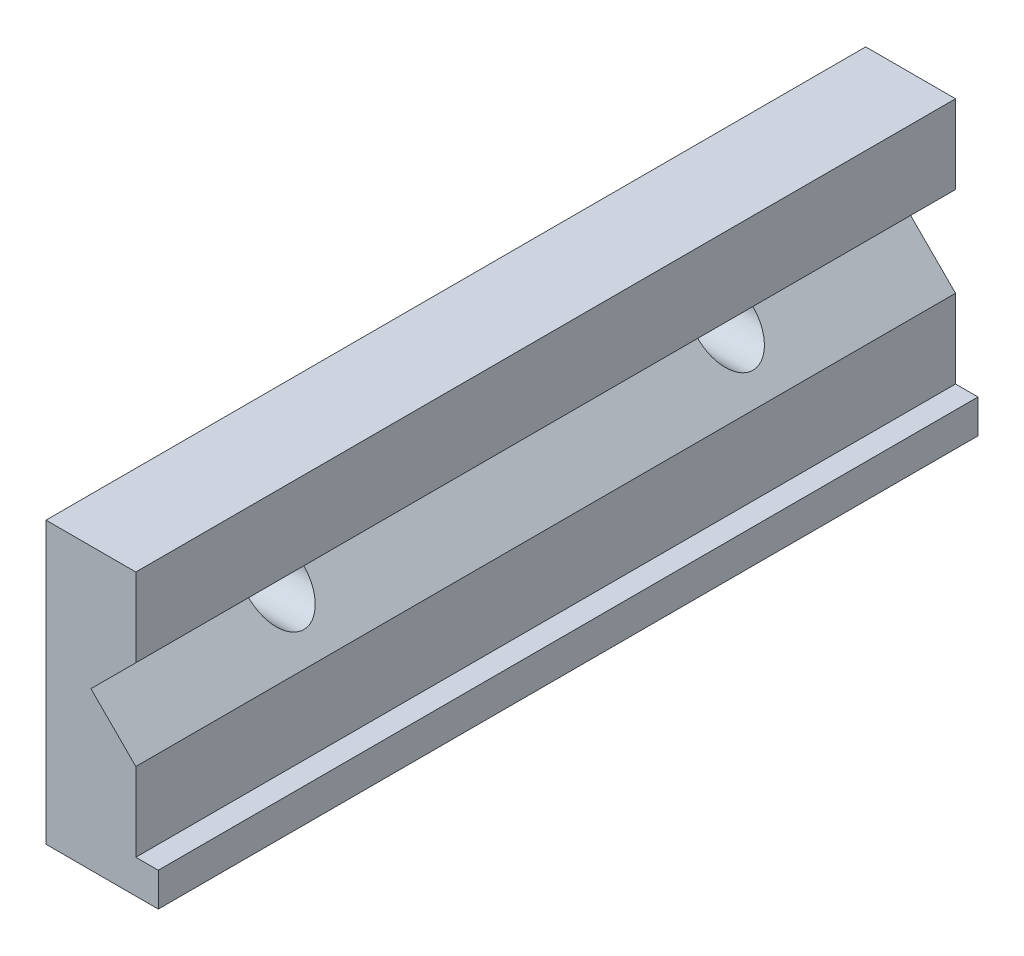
ISO-10303-21;
HEADER;
FILE_DESCRIPTION(('STEP AP214'),'2;1');
FILE_NAME('part.step','',(''),(''),'','','');
FILE_SCHEMA(('AUTOMOTIVE_DESIGN { 1 0 10303 214 1 1 1 1 }'));
ENDSEC;
DATA;
#1=APPLICATION_CONTEXT('core data for automotive mechanical design processes');
#2=APPLICATION_PROTOCOL_DEFINITION('international standard','automotive_design',2000,#1);
#3=PRODUCT_CONTEXT('',#1,'mechanical');
#4=PRODUCT('Part','Part','',(#3));
#5=PRODUCT_RELATED_PRODUCT_CATEGORY('part','',(#4));
#6=PRODUCT_DEFINITION_FORMATION('','',#4);
#7=PRODUCT_DEFINITION_CONTEXT('part definition',#1,'design');
#8=PRODUCT_DEFINITION('design','',#6,#7);
#9=PRODUCT_DEFINITION_SHAPE('','',#8);
#10=(LENGTH_UNIT() NAMED_UNIT(*) SI_UNIT(.MILLI.,.METRE.));
#11=(NAMED_UNIT(*) PLANE_ANGLE_UNIT() SI_UNIT($,.RADIAN.));
#12=(NAMED_UNIT(*) SI_UNIT($,.STERADIAN.) SOLID_ANGLE_UNIT());
#13=UNCERTAINTY_MEASURE_WITH_UNIT(LENGTH_MEASURE(1.E-05),#10,'distance_accuracy_value','');
#14=(GEOMETRIC_REPRESENTATION_CONTEXT(3) GLOBAL_UNCERTAINTY_ASSIGNED_CONTEXT((#13)) GLOBAL_UNIT_ASSIGNED_CONTEXT((#10,
#11,#12)) REPRESENTATION_CONTEXT('',''));
#15=CARTESIAN_POINT('',(0.,0.,0.));
#16=DIRECTION('',(0.,0.,1.));
#17=DIRECTION('',(1.,0.,0.));
#18=AXIS2_PLACEMENT_3D('',#15,#16,#17);
#19=CARTESIAN_POINT('',(4.,14.,0.));
#20=DIRECTION('',(-0.707106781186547,0.707106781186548,0.));
#21=DIRECTION('',(-0.707106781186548,-0.707106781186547,0.));
#22=AXIS2_PLACEMENT_3D('',#19,#20,#21);
#23=PLANE('',#22);
#24=DIRECTION('',(0.,0.,1.));
#25=VECTOR('',#24,1.);
#26=CARTESIAN_POINT('',(3.99999999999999,14.,0.));
#27=LINE('',#26,#25);
#28=CARTESIAN_POINT('',(3.99999999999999,14.,17.5415));
#29=VERTEX_POINT('',#28);
#30=CARTESIAN_POINT('',(3.99999999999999,14.,-17.5415));
#31=VERTEX_POINT('',#30);
#32=EDGE_CURVE('E71',#29,#31,#27,.F.);
#33=ORIENTED_EDGE('',*,*,#32,.T.);
#34=CARTESIAN_POINT('',(3.99999999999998,14.,-20.));
#35=DIRECTION('',(-0.707106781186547,0.707106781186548,0.));
#36=DIRECTION('',(-0.707106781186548,-0.707106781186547,0.));
#37=AXIS2_PLACEMENT_3D('',#34,#35,#36);
#38=ELLIPSE('',#37,3.47684404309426,2.4585);
#39=CARTESIAN_POINT('',(3.99999999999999,14.,-22.4585));
#40=VERTEX_POINT('',#39);
#41=EDGE_CURVE('E92',#31,#40,#38,.T.);
#42=ORIENTED_EDGE('',*,*,#41,.T.);
#43=DIRECTION('',(0.,0.,1.));
#44=VECTOR('',#43,1.);
#45=CARTESIAN_POINT('',(3.99999999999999,14.,0.));
#46=LINE('',#45,#44);
#47=CARTESIAN_POINT('',(3.99999999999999,14.,-36.5));
#48=VERTEX_POINT('',#47);
#49=EDGE_CURVE('E162',#40,#48,#46,.F.);
#50=ORIENTED_EDGE('',*,*,#49,.T.);
#51=DIRECTION('',(0.707106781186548,0.707106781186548,0.));
#52=VECTOR('',#51,1.);
#53=CARTESIAN_POINT('',(4.,14.,-36.5));
#54=LINE('',#53,#52);
#55=CARTESIAN_POINT('',(7.99999999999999,18.,-36.5));
#56=VERTEX_POINT('',#55);
#57=EDGE_CURVE('E106',#48,#56,#54,.T.);
#58=ORIENTED_EDGE('',*,*,#57,.T.);
#59=DIRECTION('',(0.,0.,1.));
#60=VECTOR('',#59,1.);
#61=CARTESIAN_POINT('',(7.99999999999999,18.,0.));
#62=LINE('',#61,#60);
#63=CARTESIAN_POINT('',(7.99999999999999,18.,36.5));
#64=VERTEX_POINT('',#63);
#65=EDGE_CURVE('E169',#56,#64,#62,.T.);
#66=ORIENTED_EDGE('',*,*,#65,.T.);
#67=DIRECTION('',(0.707106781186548,0.707106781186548,0.));
#68=VECTOR('',#67,1.);
#69=CARTESIAN_POINT('',(4.,14.,36.5));
#70=LINE('',#69,#68);
#71=CARTESIAN_POINT('',(4.,14.,36.5));
#72=VERTEX_POINT('',#71);
#73=EDGE_CURVE('E82',#72,#64,#70,.T.);
#74=ORIENTED_EDGE('',*,*,#73,.F.);
#75=DIRECTION('',(0.,0.,1.));
#76=VECTOR('',#75,1.);
#77=CARTESIAN_POINT('',(4.,14.,0.));
#78=LINE('',#77,#76);
#79=CARTESIAN_POINT('',(3.99999999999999,14.,22.4585));
#80=VERTEX_POINT('',#79);
#81=EDGE_CURVE('E76',#72,#80,#78,.F.);
#82=ORIENTED_EDGE('',*,*,#81,.T.);
#83=CARTESIAN_POINT('',(3.99999999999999,14.,20.));
#84=DIRECTION('',(-0.707106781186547,0.707106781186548,0.));
#85=DIRECTION('',(-0.707106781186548,-0.707106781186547,0.));
#86=AXIS2_PLACEMENT_3D('',#83,#84,#85);
#87=ELLIPSE('',#86,3.47684404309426,2.4585);
#88=EDGE_CURVE('E78',#80,#29,#87,.T.);
#89=ORIENTED_EDGE('',*,*,#88,.T.);
#90=EDGE_LOOP('',(#33,#42,#50,#58,#66,#74,#82,#89));
#91=FACE_BOUND('',#90,.T.);
#92=ADVANCED_FACE('F17',(#91),#23,.F.);
#93=CARTESIAN_POINT('',(8.,3.,0.));
#94=DIRECTION('',(-1.,0.,0.));
#95=DIRECTION('',(0.,-1.,0.));
#96=AXIS2_PLACEMENT_3D('',#93,#94,#95);
#97=PLANE('',#96);
#98=DIRECTION('',(0.,1.,0.));
#99=VECTOR('',#98,1.);
#100=CARTESIAN_POINT('',(7.99999999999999,12.5,-36.5));
#101=LINE('',#100,#99);
#102=CARTESIAN_POINT('',(7.99999999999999,25.,-36.5));
#103=VERTEX_POINT('',#102);
#104=EDGE_CURVE('E109',#56,#103,#101,.T.);
#105=ORIENTED_EDGE('',*,*,#104,.T.);
#106=DIRECTION('',(0.,0.,1.));
#107=VECTOR('',#106,1.);
#108=CARTESIAN_POINT('',(7.99999999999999,25.,0.));
#109=LINE('',#108,#107);
#110=CARTESIAN_POINT('',(7.99999999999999,25.,36.5));
#111=VERTEX_POINT('',#110);
#112=EDGE_CURVE('E143',#111,#103,#109,.F.);
#113=ORIENTED_EDGE('',*,*,#112,.F.);
#114=DIRECTION('',(0.,1.,0.));
#115=VECTOR('',#114,1.);
#116=CARTESIAN_POINT('',(7.99999999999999,12.5,36.5));
#117=LINE('',#116,#115);
#118=EDGE_CURVE('E118',#64,#111,#117,.T.);
#119=ORIENTED_EDGE('',*,*,#118,.F.);
#120=ORIENTED_EDGE('',*,*,#65,.F.);
#121=EDGE_LOOP('',(#105,#113,#119,#120));
#122=FACE_BOUND('',#121,.T.);
#123=ADVANCED_FACE('F178',(#122),#97,.F.);
#124=CARTESIAN_POINT('',(10.,3.,0.));
#125=DIRECTION('',(0.,-1.,0.));
#126=DIRECTION('',(1.,0.,0.));
#127=AXIS2_PLACEMENT_3D('',#124,#125,#126);
#128=PLANE('',#127);
#129=DIRECTION('',(0.,0.,-1.));
#130=VECTOR('',#129,1.);
#131=CARTESIAN_POINT('',(10.,3.,0.));
#132=LINE('',#131,#130);
#133=CARTESIAN_POINT('',(10.,3.,-36.5));
#134=VERTEX_POINT('',#133);
#135=CARTESIAN_POINT('',(10.,3.,36.5));
#136=VERTEX_POINT('',#135);
#137=EDGE_CURVE('E85',#134,#136,#132,.F.);
#138=ORIENTED_EDGE('',*,*,#137,.F.);
#139=DIRECTION('',(1.,0.,0.));
#140=VECTOR('',#139,1.);
#141=CARTESIAN_POINT('',(5.,3.,-36.5));
#142=LINE('',#141,#140);
#143=CARTESIAN_POINT('',(8.,3.,-36.5));
#144=VERTEX_POINT('',#143);
#145=EDGE_CURVE('E138',#134,#144,#142,.F.);
#146=ORIENTED_EDGE('',*,*,#145,.T.);
#147=DIRECTION('',(0.,0.,1.));
#148=VECTOR('',#147,1.);
#149=CARTESIAN_POINT('',(8.,3.,0.));
#150=LINE('',#149,#148);
#151=CARTESIAN_POINT('',(8.,3.,36.5));
#152=VERTEX_POINT('',#151);
#153=EDGE_CURVE('E163',#144,#152,#150,.T.);
#154=ORIENTED_EDGE('',*,*,#153,.T.);
#155=DIRECTION('',(1.,0.,0.));
#156=VECTOR('',#155,1.);
#157=CARTESIAN_POINT('',(5.,3.,36.5));
#158=LINE('',#157,#156);
#159=EDGE_CURVE('E154',#136,#152,#158,.F.);
#160=ORIENTED_EDGE('',*,*,#159,.F.);
#161=EDGE_LOOP('',(#138,#146,#154,#160));
#162=FACE_BOUND('',#161,.T.);
#163=ADVANCED_FACE('F281',(#162),#128,.F.);
#164=CARTESIAN_POINT('',(8.,3.,0.));
#165=DIRECTION('',(-1.,0.,0.));
#166=DIRECTION('',(0.,-1.,0.));
#167=AXIS2_PLACEMENT_3D('',#164,#165,#166);
#168=PLANE('',#167);
#169=DIRECTION('',(0.,1.,0.));
#170=VECTOR('',#169,1.);
#171=CARTESIAN_POINT('',(8.,12.5,36.5));
#172=LINE('',#171,#170);
#173=CARTESIAN_POINT('',(8.,10.,36.5));
#174=VERTEX_POINT('',#173);
#175=EDGE_CURVE('E146',#152,#174,#172,.T.);
#176=ORIENTED_EDGE('',*,*,#175,.F.);
#177=ORIENTED_EDGE('',*,*,#153,.F.);
#178=DIRECTION('',(0.,1.,0.));
#179=VECTOR('',#178,1.);
#180=CARTESIAN_POINT('',(8.,12.5,-36.5));
#181=LINE('',#180,#179);
#182=CARTESIAN_POINT('',(8.,10.,-36.5));
#183=VERTEX_POINT('',#182);
#184=EDGE_CURVE('E115',#144,#183,#181,.T.);
#185=ORIENTED_EDGE('',*,*,#184,.T.);
#186=DIRECTION('',(0.,0.,1.));
#187=VECTOR('',#186,1.);
#188=CARTESIAN_POINT('',(8.,10.,0.));
#189=LINE('',#188,#187);
#190=EDGE_CURVE('E86',#183,#174,#189,.T.);
#191=ORIENTED_EDGE('',*,*,#190,.T.);
#192=EDGE_LOOP('',(#176,#177,#185,#191));
#193=FACE_BOUND('',#192,.T.);
#194=ADVANCED_FACE('F274',(#193),#168,.F.);
#195=CARTESIAN_POINT('',(10.,8.,0.));
#196=DIRECTION('',(-0.707106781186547,-0.707106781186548,0.));
#197=DIRECTION('',(0.707106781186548,-0.707106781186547,0.));
#198=AXIS2_PLACEMENT_3D('',#195,#196,#197);
#199=PLANE('',#198);
#200=ORIENTED_EDGE('',*,*,#81,.F.);
#201=DIRECTION('',(-0.707106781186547,0.707106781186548,0.));
#202=VECTOR('',#201,1.);
#203=CARTESIAN_POINT('',(8.,10.,36.5));
#204=LINE('',#203,#202);
#205=EDGE_CURVE('E97',#174,#72,#204,.T.);
#206=ORIENTED_EDGE('',*,*,#205,.F.);
#207=ORIENTED_EDGE('',*,*,#190,.F.);
#208=DIRECTION('',(-0.707106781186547,0.707106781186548,0.));
#209=VECTOR('',#208,1.);
#210=CARTESIAN_POINT('',(8.,10.,-36.5));
#211=LINE('',#210,#209);
#212=EDGE_CURVE('E111',#183,#48,#211,.T.);
#213=ORIENTED_EDGE('',*,*,#212,.T.);
#214=ORIENTED_EDGE('',*,*,#49,.F.);
#215=CARTESIAN_POINT('',(3.99999999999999,14.,-20.));
#216=DIRECTION('',(-0.707106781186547,-0.707106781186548,0.));
#217=DIRECTION('',(-0.707106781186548,0.707106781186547,0.));
#218=AXIS2_PLACEMENT_3D('',#215,#216,#217);
#219=ELLIPSE('',#218,3.47684404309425,2.4585);
#220=EDGE_CURVE('E91',#40,#31,#219,.T.);
#221=ORIENTED_EDGE('',*,*,#220,.T.);
#222=ORIENTED_EDGE('',*,*,#32,.F.);
#223=CARTESIAN_POINT('',(3.99999999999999,14.,20.));
#224=DIRECTION('',(-0.707106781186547,-0.707106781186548,0.));
#225=DIRECTION('',(-0.707106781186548,0.707106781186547,0.));
#226=AXIS2_PLACEMENT_3D('',#223,#224,#225);
#227=ELLIPSE('',#226,3.47684404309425,2.4585);
#228=EDGE_CURVE('E21',#29,#80,#227,.T.);
#229=ORIENTED_EDGE('',*,*,#228,.T.);
#230=EDGE_LOOP('',(#200,#206,#207,#213,#214,#221,#222,#229));
#231=FACE_BOUND('',#230,.T.);
#232=ADVANCED_FACE('F88',(#231),#199,.F.);
#233=CARTESIAN_POINT('',(10.,25.,0.));
#234=DIRECTION('',(1.,0.,0.));
#235=DIRECTION('',(0.,0.,-1.));
#236=AXIS2_PLACEMENT_3D('',#233,#234,#235);
#237=PLANE('',#236);
#238=DIRECTION('',(0.,0.,-1.));
#239=VECTOR('',#238,1.);
#240=CARTESIAN_POINT('',(10.,0.,0.));
#241=LINE('',#240,#239);
#242=CARTESIAN_POINT('',(10.,0.,-36.5));
#243=VERTEX_POINT('',#242);
#244=CARTESIAN_POINT('',(10.,0.,36.5));
#245=VERTEX_POINT('',#244);
#246=EDGE_CURVE('E102',#243,#245,#241,.F.);
#247=ORIENTED_EDGE('',*,*,#246,.F.);
#248=DIRECTION('',(0.,1.,0.));
#249=VECTOR('',#248,1.);
#250=CARTESIAN_POINT('',(10.,12.5,-36.5));
#251=LINE('',#250,#249);
#252=EDGE_CURVE('E135',#243,#134,#251,.T.);
#253=ORIENTED_EDGE('',*,*,#252,.T.);
#254=ORIENTED_EDGE('',*,*,#137,.T.);
#255=DIRECTION('',(0.,1.,0.));
#256=VECTOR('',#255,1.);
#257=CARTESIAN_POINT('',(10.,12.5,36.5));
#258=LINE('',#257,#256);
#259=EDGE_CURVE('E151',#245,#136,#258,.T.);
#260=ORIENTED_EDGE('',*,*,#259,.F.);
#261=EDGE_LOOP('',(#247,#253,#254,#260));
#262=FACE_BOUND('',#261,.T.);
#263=ADVANCED_FACE('F204',(#262),#237,.T.);
#264=CARTESIAN_POINT('',(77.8074546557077,14.,20.));
#265=DIRECTION('',(-1.,0.,0.));
#266=DIRECTION('',(0.,-1.,0.));
#267=AXIS2_PLACEMENT_3D('',#264,#265,#266);
#268=CYLINDRICAL_SURFACE('',#267,2.4585);
#269=CARTESIAN_POINT('',(0.,14.,20.));
#270=DIRECTION('',(-1.,0.,0.));
#271=DIRECTION('',(0.,-1.,0.));
#272=AXIS2_PLACEMENT_3D('',#269,#270,#271);
#273=CIRCLE('',#272,2.4585);
#274=CARTESIAN_POINT('',(0.,11.5415,20.));
#275=VERTEX_POINT('',#274);
#276=EDGE_CURVE('E98',#275,#275,#273,.F.);
#277=ORIENTED_EDGE('',*,*,#276,.F.);
#278=EDGE_LOOP('',(#277));
#279=FACE_BOUND('',#278,.T.);
#280=ORIENTED_EDGE('',*,*,#228,.F.);
#281=ORIENTED_EDGE('',*,*,#88,.F.);
#282=EDGE_LOOP('',(#280,#281));
#283=FACE_BOUND('',#282,.T.);
#284=ADVANCED_FACE('F90',(#279,#283),#268,.F.);
#285=CARTESIAN_POINT('',(77.8074546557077,14.,-20.));
#286=DIRECTION('',(-1.,0.,0.));
#287=DIRECTION('',(0.,-1.,0.));
#288=AXIS2_PLACEMENT_3D('',#285,#286,#287);
#289=CYLINDRICAL_SURFACE('',#288,2.4585);
#290=CARTESIAN_POINT('',(0.,14.,-20.));
#291=DIRECTION('',(-1.,0.,0.));
#292=DIRECTION('',(0.,-1.,0.));
#293=AXIS2_PLACEMENT_3D('',#290,#291,#292);
#294=CIRCLE('',#293,2.4585);
#295=CARTESIAN_POINT('',(0.,11.5415,-20.));
#296=VERTEX_POINT('',#295);
#297=EDGE_CURVE('E101',#296,#296,#294,.F.);
#298=ORIENTED_EDGE('',*,*,#297,.F.);
#299=EDGE_LOOP('',(#298));
#300=FACE_BOUND('',#299,.T.);
#301=ORIENTED_EDGE('',*,*,#220,.F.);
#302=ORIENTED_EDGE('',*,*,#41,.F.);
#303=EDGE_LOOP('',(#301,#302));
#304=FACE_BOUND('',#303,.T.);
#305=ADVANCED_FACE('F224',(#300,#304),#289,.F.);
#306=CARTESIAN_POINT('',(5.,12.5,36.5));
#307=DIRECTION('',(0.,0.,1.));
#308=DIRECTION('',(1.,0.,0.));
#309=AXIS2_PLACEMENT_3D('',#306,#307,#308);
#310=PLANE('',#309);
#311=ORIENTED_EDGE('',*,*,#159,.T.);
#312=ORIENTED_EDGE('',*,*,#175,.T.);
#313=ORIENTED_EDGE('',*,*,#205,.T.);
#314=ORIENTED_EDGE('',*,*,#73,.T.);
#315=ORIENTED_EDGE('',*,*,#118,.T.);
#316=DIRECTION('',(1.,0.,0.));
#317=VECTOR('',#316,1.);
#318=CARTESIAN_POINT('',(0.,25.,36.5));
#319=LINE('',#318,#317);
#320=CARTESIAN_POINT('',(0.,25.,36.5));
#321=VERTEX_POINT('',#320);
#322=EDGE_CURVE('E110',#321,#111,#319,.T.);
#323=ORIENTED_EDGE('',*,*,#322,.F.);
#324=DIRECTION('',(0.,-1.,0.));
#325=VECTOR('',#324,1.);
#326=CARTESIAN_POINT('',(0.,0.,36.5));
#327=LINE('',#326,#325);
#328=CARTESIAN_POINT('',(0.,0.,36.5));
#329=VERTEX_POINT('',#328);
#330=EDGE_CURVE('E105',#329,#321,#327,.F.);
#331=ORIENTED_EDGE('',*,*,#330,.F.);
#332=DIRECTION('',(1.,0.,0.));
#333=VECTOR('',#332,1.);
#334=CARTESIAN_POINT('',(10.,0.,36.5));
#335=LINE('',#334,#333);
#336=EDGE_CURVE('E114',#245,#329,#335,.F.);
#337=ORIENTED_EDGE('',*,*,#336,.F.);
#338=ORIENTED_EDGE('',*,*,#259,.T.);
#339=EDGE_LOOP('',(#311,#312,#313,#314,#315,#323,#331,#337,#338));
#340=FACE_BOUND('',#339,.T.);
#341=ADVANCED_FACE('F180',(#340),#310,.T.);
#342=CARTESIAN_POINT('',(0.,25.,0.));
#343=DIRECTION('',(0.,1.,0.));
#344=DIRECTION('',(0.,0.,1.));
#345=AXIS2_PLACEMENT_3D('',#342,#343,#344);
#346=PLANE('',#345);
#347=DIRECTION('',(0.,0.,1.));
#348=VECTOR('',#347,1.);
#349=CARTESIAN_POINT('',(0.,25.,0.));
#350=LINE('',#349,#348);
#351=CARTESIAN_POINT('',(0.,25.,-36.5));
#352=VERTEX_POINT('',#351);
#353=EDGE_CURVE('E121',#321,#352,#350,.F.);
#354=ORIENTED_EDGE('',*,*,#353,.F.);
#355=ORIENTED_EDGE('',*,*,#322,.T.);
#356=ORIENTED_EDGE('',*,*,#112,.T.);
#357=DIRECTION('',(1.,0.,0.));
#358=VECTOR('',#357,1.);
#359=CARTESIAN_POINT('',(5.,25.,-36.5));
#360=LINE('',#359,#358);
#361=EDGE_CURVE('E133',#103,#352,#360,.F.);
#362=ORIENTED_EDGE('',*,*,#361,.T.);
#363=EDGE_LOOP('',(#354,#355,#356,#362));
#364=FACE_BOUND('',#363,.T.);
#365=ADVANCED_FACE('F215',(#364),#346,.T.);
#366=CARTESIAN_POINT('',(5.,12.5,-36.5));
#367=DIRECTION('',(0.,0.,1.));
#368=DIRECTION('',(1.,0.,0.));
#369=AXIS2_PLACEMENT_3D('',#366,#367,#368);
#370=PLANE('',#369);
#371=ORIENTED_EDGE('',*,*,#184,.F.);
#372=ORIENTED_EDGE('',*,*,#145,.F.);
#373=ORIENTED_EDGE('',*,*,#252,.F.);
#374=DIRECTION('',(1.,0.,0.));
#375=VECTOR('',#374,1.);
#376=CARTESIAN_POINT('',(10.,0.,-36.5));
#377=LINE('',#376,#375);
#378=CARTESIAN_POINT('',(0.,0.,-36.5));
#379=VERTEX_POINT('',#378);
#380=EDGE_CURVE('E36',#379,#243,#377,.T.);
#381=ORIENTED_EDGE('',*,*,#380,.F.);
#382=DIRECTION('',(0.,-1.,0.));
#383=VECTOR('',#382,1.);
#384=CARTESIAN_POINT('',(0.,0.,-36.5));
#385=LINE('',#384,#383);
#386=EDGE_CURVE('E27',#352,#379,#385,.T.);
#387=ORIENTED_EDGE('',*,*,#386,.F.);
#388=ORIENTED_EDGE('',*,*,#361,.F.);
#389=ORIENTED_EDGE('',*,*,#104,.F.);
#390=ORIENTED_EDGE('',*,*,#57,.F.);
#391=ORIENTED_EDGE('',*,*,#212,.F.);
#392=EDGE_LOOP('',(#371,#372,#373,#381,#387,#388,#389,#390,#391));
#393=FACE_BOUND('',#392,.T.);
#394=ADVANCED_FACE('F213',(#393),#370,.F.);
#395=CARTESIAN_POINT('',(10.,0.,0.));
#396=DIRECTION('',(0.,-1.,0.));
#397=DIRECTION('',(0.,0.,-1.));
#398=AXIS2_PLACEMENT_3D('',#395,#396,#397);
#399=PLANE('',#398);
#400=ORIENTED_EDGE('',*,*,#380,.T.);
#401=ORIENTED_EDGE('',*,*,#246,.T.);
#402=ORIENTED_EDGE('',*,*,#336,.T.);
#403=DIRECTION('',(0.,0.,1.));
#404=VECTOR('',#403,1.);
#405=CARTESIAN_POINT('',(0.,0.,0.));
#406=LINE('',#405,#404);
#407=EDGE_CURVE('E11',#379,#329,#406,.T.);
#408=ORIENTED_EDGE('',*,*,#407,.F.);
#409=EDGE_LOOP('',(#400,#401,#402,#408));
#410=FACE_BOUND('',#409,.T.);
#411=ADVANCED_FACE('F207',(#410),#399,.T.);
#412=CARTESIAN_POINT('',(0.,0.,0.));
#413=DIRECTION('',(-1.,0.,0.));
#414=DIRECTION('',(0.,-1.,0.));
#415=AXIS2_PLACEMENT_3D('',#412,#413,#414);
#416=PLANE('',#415);
#417=ORIENTED_EDGE('',*,*,#386,.T.);
#418=ORIENTED_EDGE('',*,*,#407,.T.);
#419=ORIENTED_EDGE('',*,*,#330,.T.);
#420=ORIENTED_EDGE('',*,*,#353,.T.);
#421=EDGE_LOOP('',(#417,#418,#419,#420));
#422=FACE_BOUND('',#421,.T.);
#423=ORIENTED_EDGE('',*,*,#297,.T.);
#424=EDGE_LOOP('',(#423));
#425=FACE_BOUND('',#424,.T.);
#426=ORIENTED_EDGE('',*,*,#276,.T.);
#427=EDGE_LOOP('',(#426));
#428=FACE_BOUND('',#427,.T.);
#429=ADVANCED_FACE('F19',(#422,#425,#428),#416,.T.);
#430=CLOSED_SHELL('',(#92,#123,#163,#194,#232,#263,#284,#305,#341,#365,#394,#411,#429));
#431=MANIFOLD_SOLID_BREP('B1',#430);
#432=ADVANCED_BREP_SHAPE_REPRESENTATION('',(#18,#431),#14);
#433=SHAPE_DEFINITION_REPRESENTATION(#9,#432);
ENDSEC;
END-ISO-10303-21;
